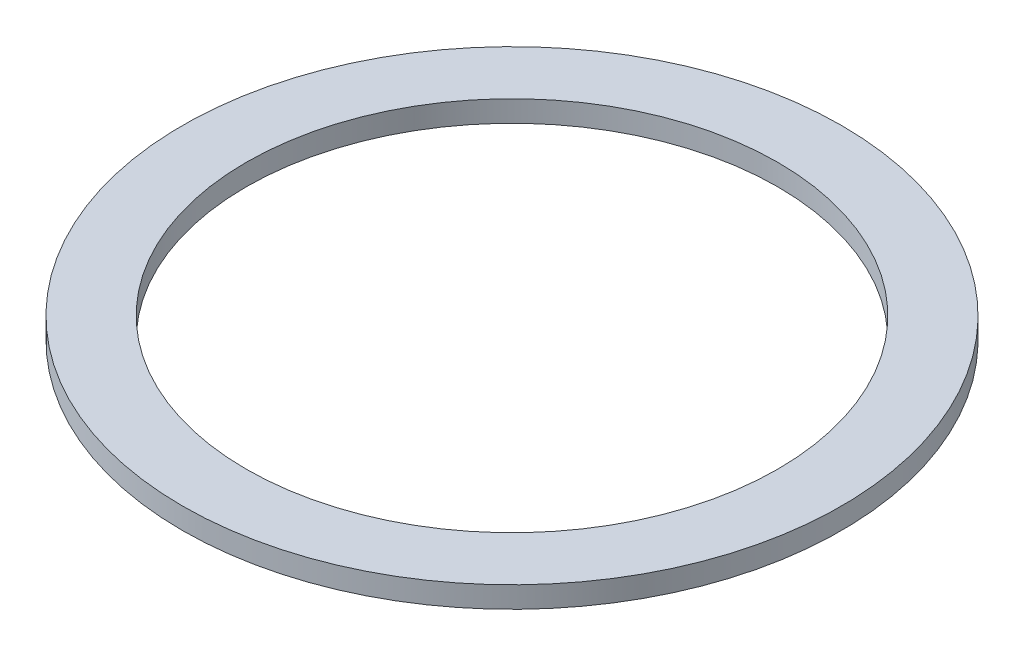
from build123d import *

# Parameters (mm, degrees)
SKETCH1_R           = 12.4
SKETCH1_R_2         = 10
BOSS_EXTRUDE1_DEPTH = 0.8


with BuildPart() as part:
    # Sketch1 → Boss-Extrude1 (new body)
    with BuildSketch(Plane(origin=(0, 0, 0), x_dir=(1, 0, 0), z_dir=(0, 1, 0))):
        with Locations(Location((0, 0, 0), (0, 0, 270))):
            Circle(SKETCH1_R)
        with Locations(Location((0, 0, 0), (0, 0, 270))):
            Circle(SKETCH1_R_2, mode=Mode.SUBTRACT)
    extrude(amount=BOSS_EXTRUDE1_DEPTH)


solid = part.part
